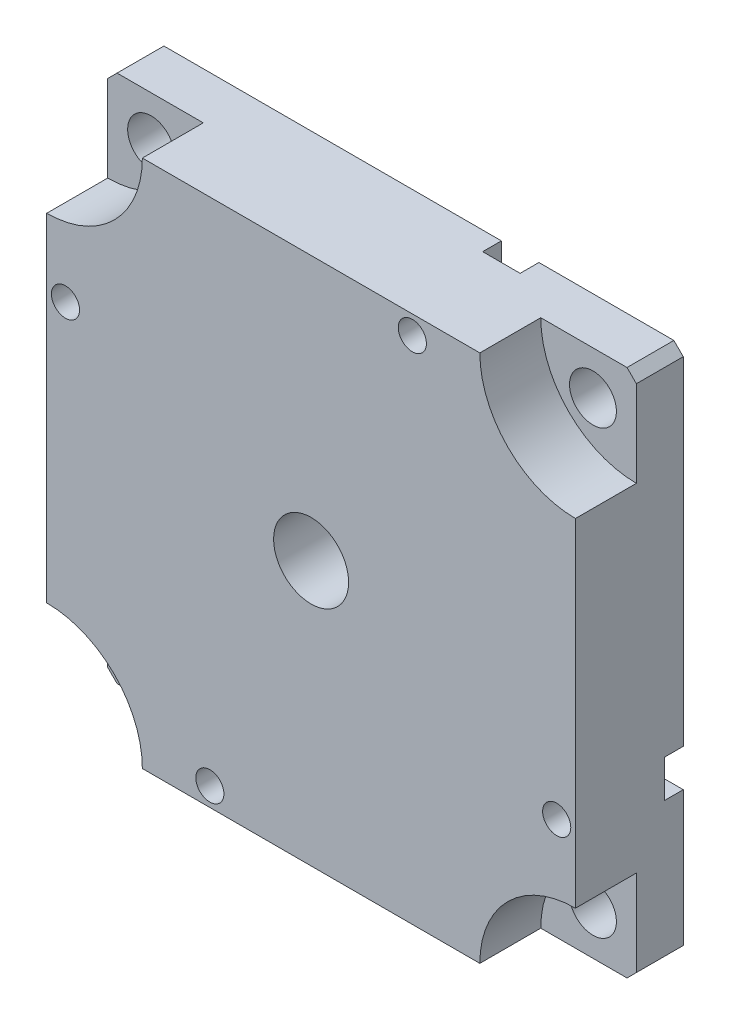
from build123d import *

# Parameters (mm, degrees)
EXTRUDE_1_DEPTH          = 5
SKETCH_2_R               = 2.5
CUT_EXTRUDE_1_DEPTH      = 5
EXTRUDE_2_DEPTH          = 6.5
SKETCH_4_R               = 19.55
SKETCH_4_R_2             = 19.05
CUT_EXTRUDE_2_DEPTH      = 1
EXTRUDE_START            = 1.6
SKETCH_5_R               = 19.05
EXTRUDE_3_DEPTH          = 1.6
SKETCH_6_R               = 4
CUT_EXTRUDE_3_DEPTH      = 20
CUT_EXTRUDE_4_DEPTH      = 2
PATTERN_CIRCULAR_1_COUNT = 4
SKETCH_12_R              = 1.5
CUT_EXTRUDE_5_DEPTH      = 50
PATTERN_CIRCULAR_2_COUNT = 4


with BuildPart() as part:
    # Sketch 1 → Extrude 1 (new body)
    with BuildSketch(Plane.XY):
        Polygon((-28.2, 27.2), (-27.2, 28.2), (27.2, 28.2), (28.2, 27.2), (28.2, -27.2), (27.2, -28.2), (-27.2, -28.2), (-28.2, -27.2), align=None)
    extrude(amount=EXTRUDE_1_DEPTH)

    # Sketch 2 → Cut-Extrude 1 (cut)
    with BuildSketch(Plane(origin=(0, 0, 0), x_dir=(-1, 0, 0), z_dir=(0, 0, -1))):
        with Locations((-23.57, 23.57)):
            Circle(SKETCH_2_R)
        with Locations((23.57, 23.57)):
            Circle(SKETCH_2_R)
        with Locations((-23.57, -23.57)):
            Circle(SKETCH_2_R)
        with Locations((23.57, -23.57)):
            Circle(SKETCH_2_R)
    extrude(amount=-CUT_EXTRUDE_1_DEPTH, mode=Mode.SUBTRACT)

    # Sketch 3 → Extrude 2 (add)
    with BuildSketch(Plane.XY.offset(5)):
        with BuildLine():
            Line((18, -28.2), (-18, -28.2))
            ThreePointArc((-18, -28.2), (-20.987510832, -20.987510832), (-28.2, -18))
            Line((-28.2, -18), (-28.2, 18))
            ThreePointArc((-28.2, 18), (-20.987510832, 20.987510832), (-18, 28.2))
            Line((-18, 28.2), (18, 28.2))
            ThreePointArc((18, 28.2), (20.987510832, 20.987510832), (28.2, 18))
            Line((28.2, 18), (28.2, -18))
            ThreePointArc((28.2, -18), (20.987510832, -20.987510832), (18, -28.2))
        make_face()
    extrude(amount=EXTRUDE_2_DEPTH)

    # Sketch 4 → Cut-Extrude 2 (cut)
    with BuildSketch(Plane(origin=(0, 0, 0), x_dir=(-1, 0, 0), z_dir=(0, 0, -1))):
        Circle(SKETCH_4_R)
        Circle(SKETCH_4_R_2, mode=Mode.SUBTRACT)
    extrude(amount=-CUT_EXTRUDE_2_DEPTH, mode=Mode.SUBTRACT)

    # Sketch 5 → Extrude 3 (add)
    with BuildSketch(Plane(origin=(0, 0, 0), x_dir=(-1, 0, 0), z_dir=(0, 0, -1)).offset(EXTRUDE_START)):
        Circle(SKETCH_5_R)
    extrude(amount=-EXTRUDE_3_DEPTH)

    # Sketch 6 → Cut-Extrude 3 (cut)
    with BuildSketch(Plane(origin=(0, 0, -1.6), x_dir=(-1, 0, 0), z_dir=(0, 0, -1))):
        Circle(SKETCH_6_R)
    extrude(amount=-CUT_EXTRUDE_3_DEPTH, mode=Mode.SUBTRACT)

    # Sketch 10 → Cut-Extrude 4 (cut)
    with BuildSketch(Plane(origin=(0, 0, 0), x_dir=(-1, 0, 0), z_dir=(0, 0, -1))):
        with BuildLine():
            Line((-12.8, 26.2), (-12.8, 28.2))
            Line((-12.8, 28.2), (-8.8, 28.2))
            Line((-8.8, 28.2), (-8.8, 26.2))
            ThreePointArc((-8.8, 26.2), (-10.8, 24.2), (-12.8, 26.2))
        make_face()
    cut_extrude_4 = extrude(amount=-CUT_EXTRUDE_4_DEPTH, mode=Mode.SUBTRACT)

    # Pattern Circular 1: Cut-Extrude 4 ×4 about axis
    pattern_circular_1_axis = Axis((0, 0, 0), (0, 0, 1))
    for i in range(1, PATTERN_CIRCULAR_1_COUNT):
        add(cut_extrude_4.rotate(pattern_circular_1_axis, i * 360 / PATTERN_CIRCULAR_1_COUNT), mode=Mode.SUBTRACT)

    # Sketch 12 → Cut-Extrude 5 (cut)
    with BuildSketch(Plane(origin=(0, 0, 0), x_dir=(-1, 0, 0), z_dir=(0, 0, -1))):
        with Locations((-10.8, 26.2)):
            Circle(SKETCH_12_R)
    cut_extrude_5 = extrude(amount=-CUT_EXTRUDE_5_DEPTH, mode=Mode.SUBTRACT)

    # Pattern Circular 2: Cut-Extrude 5 ×4 about axis
    pattern_circular_2_axis = Axis((0, 0, 0), (0, 0, 1))
    for i in range(1, PATTERN_CIRCULAR_2_COUNT):
        add(cut_extrude_5.rotate(pattern_circular_2_axis, i * 360 / PATTERN_CIRCULAR_2_COUNT), mode=Mode.SUBTRACT)


solid = part.part
